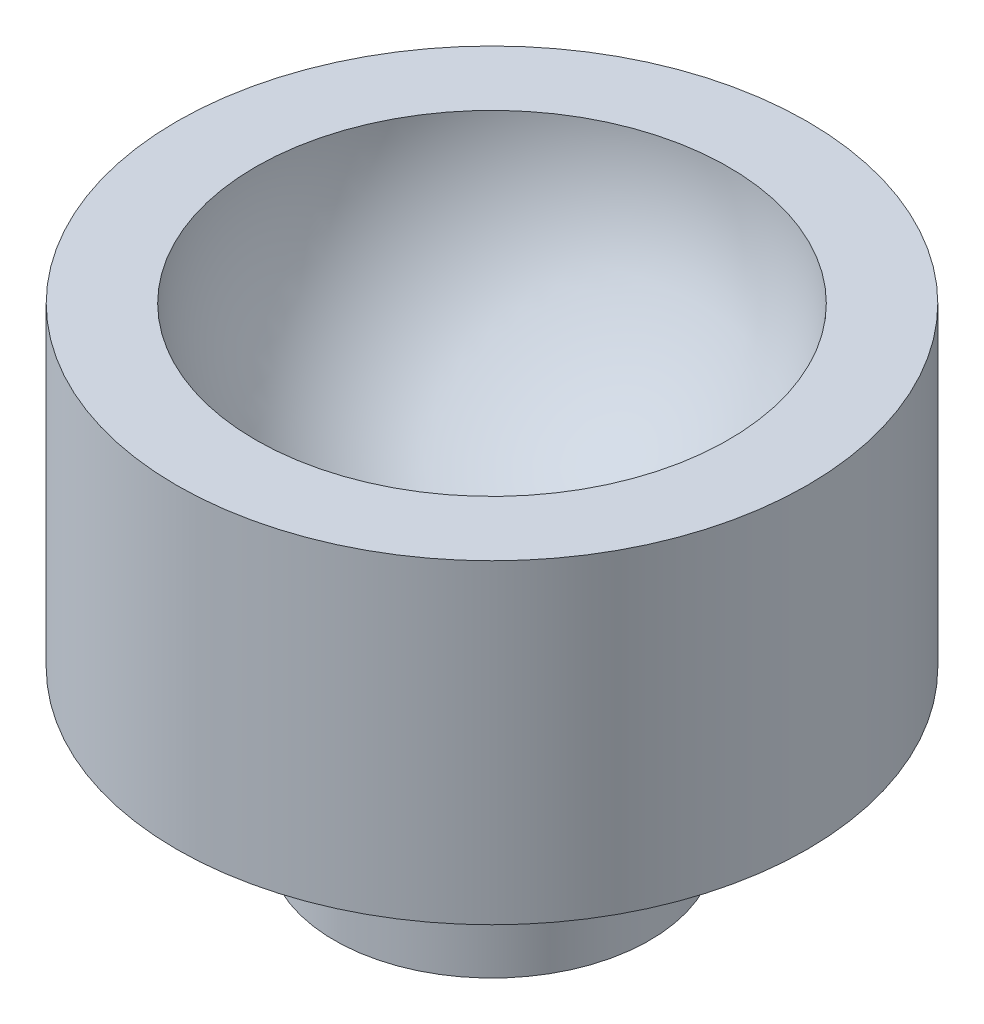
from build123d import *


with BuildPart() as part:
    # Sketch 1 → Revolve 1 (revolve)
    with BuildSketch(Plane.XY, mode=Mode.PRIVATE) as revolve_1_sk:
        Polygon((0, 0), (10, 0), (10, 10), (20, 10), (20, 30), (0, 30), align=None)
    revolve(revolve_1_sk.sketch.rotate(Axis((0, -25.128026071, 0), (0, 1, 0)), 90), axis=Axis((0, -25.128026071, 0), (0, 1, 0)))

    # Sketch 2 → Cut-Revolve 2 (revolve, cut)
    with BuildSketch(Plane.XY):
        with BuildLine():
            Line((0, 15.138381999), (0, 45.138381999))
            ThreePointArc((0, 45.138381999), (15, 30.138381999), (0, 15.138381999))
        make_face()
    revolve(axis=Axis((0, 13.360505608, 0), (0, 1, 0)), mode=Mode.SUBTRACT)


solid = part.part
